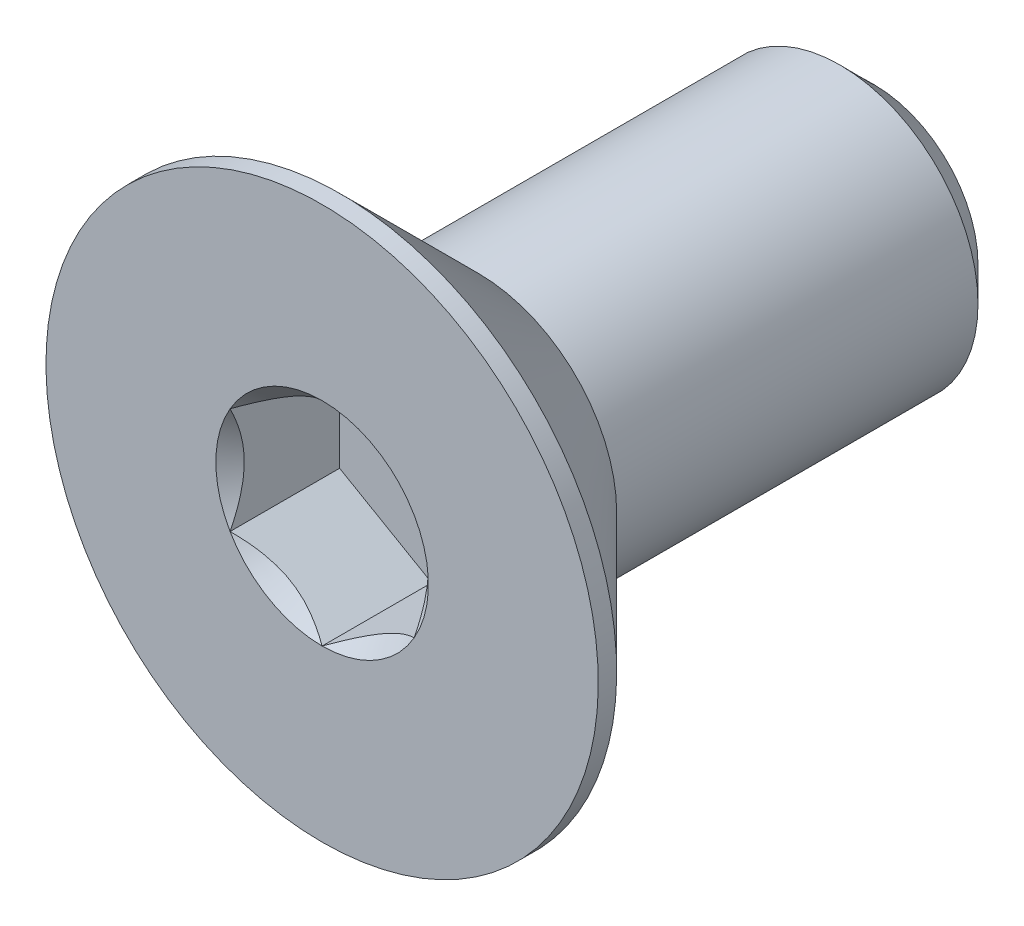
from build123d import *

# Parameters (mm, degrees)
SKETCH1_W          = 6
SKETCH1_H          = 1.5
CHAMFER1_SIZE      = 0.375
CUT_EXTRUDE2_DEPTH = 1.19


with BuildPart() as part:
    # Sketch1 → Revolve1 (revolve)
    with BuildSketch(Plane(origin=(0, 0, 0), x_dir=(0, 0, -1), z_dir=(1, 0, 0))):
        with Locations((3, 0.75)):
            Rectangle(SKETCH1_W, SKETCH1_H)
    revolve(axis=Axis((0, 0, -6), (0, 0, 1)))

    # Chamfer1
    chamfer1_edges = [part.edges().sort_by_distance(p)[0] for p in [
        (0, -1.5, -6),
    ]]
    chamfer(chamfer1_edges, length=CHAMFER1_SIZE)

    # Sketch7 → Revolve2 (revolve)
    with BuildSketch(Plane(origin=(0, 0, 0), x_dir=(0, 0, -1), z_dir=(1, 0, 0)), mode=Mode.PRIVATE) as revolve2_sk:
        Polygon((0, 3), (0.2, 3), (1.7, 1.5), (1.7, 0), (0, 0), align=None)
    revolve(revolve2_sk.sketch.rotate(Axis((0, 0, 0), (0, 0, -1)), 180), axis=Axis((0, 0, 0), (0, 0, -1)))

    # Boss-Extrude1 cone 1 section (on through the dimple's axis) → Boss-Extrude1 (revolve)
    with BuildSketch(Plane(origin=(0, 0, -1.7), x_dir=(0, -1, 0), z_dir=(1, 0, 0))):
        Polygon((0, 0), (1.5, 0), (0, 1.5), align=None)
    revolve(axis=Axis((0, 0, -1.7), (0, 0, -1)))

    # Sketch5 → Cut-Extrude2 (cut)
    with BuildSketch(Plane.XY):
        Polygon((1, -0.577350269), (1, 0.577350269), (0, 1.154700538), (-1, 0.577350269), (-1, -0.577350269), (0, -1.154700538), align=None)
    extrude(amount=-CUT_EXTRUDE2_DEPTH, mode=Mode.SUBTRACT)

    # Cut-Extrude3 cone 1 section (on through the dimple's axis) → Cut-Extrude3 (revolve, cut)
    with BuildSketch(Plane(origin=(0, 0, 0), x_dir=(0, -1, 0), z_dir=(1, 0, 0))):
        Polygon((0, 0), (1.154700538, 0), (0, 1.154700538), align=None)
    revolve(axis=Axis((0, 0, 0), (0, 0, -1)), mode=Mode.SUBTRACT)


solid = part.part
